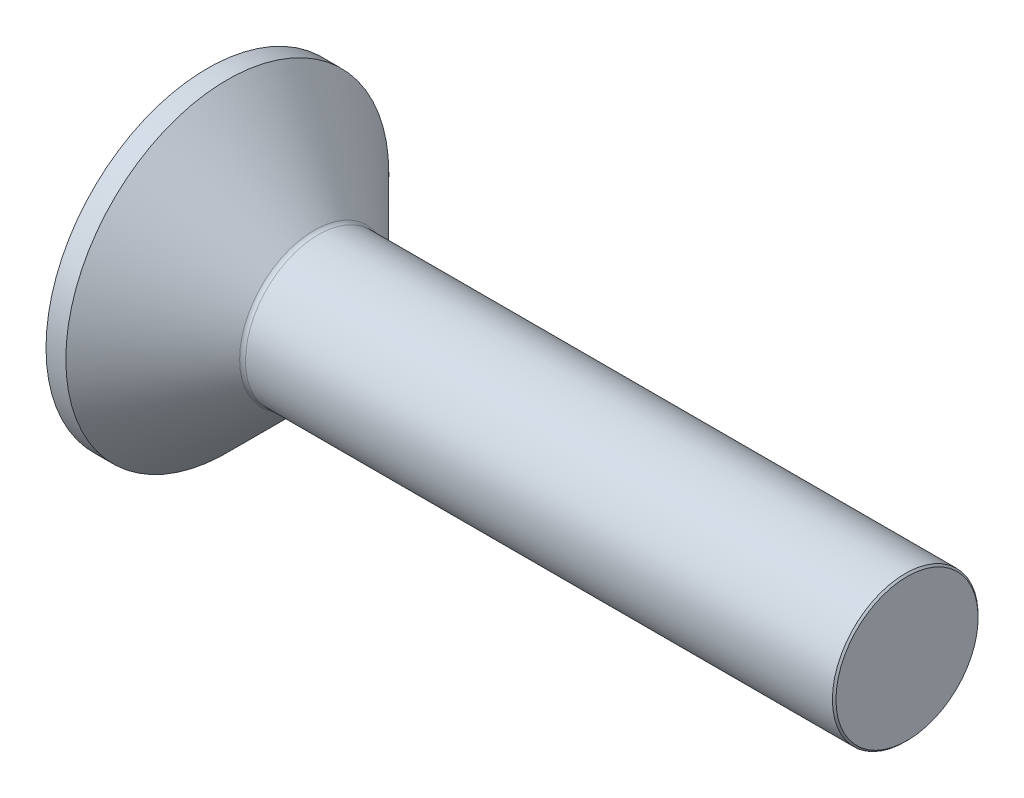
ISO-10303-21;
HEADER;
FILE_DESCRIPTION(('STEP AP214'),'2;1');
FILE_NAME('part.step','',(''),(''),'','','');
FILE_SCHEMA(('AUTOMOTIVE_DESIGN { 1 0 10303 214 1 1 1 1 }'));
ENDSEC;
DATA;
#1=APPLICATION_CONTEXT('core data for automotive mechanical design processes');
#2=APPLICATION_PROTOCOL_DEFINITION('international standard','automotive_design',2000,#1);
#3=PRODUCT_CONTEXT('',#1,'mechanical');
#4=PRODUCT('Part','Part','',(#3));
#5=PRODUCT_RELATED_PRODUCT_CATEGORY('part','',(#4));
#6=PRODUCT_DEFINITION_FORMATION('','',#4);
#7=PRODUCT_DEFINITION_CONTEXT('part definition',#1,'design');
#8=PRODUCT_DEFINITION('design','',#6,#7);
#9=PRODUCT_DEFINITION_SHAPE('','',#8);
#10=(LENGTH_UNIT() NAMED_UNIT(*) SI_UNIT(.MILLI.,.METRE.));
#11=(NAMED_UNIT(*) PLANE_ANGLE_UNIT() SI_UNIT($,.RADIAN.));
#12=(NAMED_UNIT(*) SI_UNIT($,.STERADIAN.) SOLID_ANGLE_UNIT());
#13=UNCERTAINTY_MEASURE_WITH_UNIT(LENGTH_MEASURE(1.E-05),#10,'distance_accuracy_value','');
#14=(GEOMETRIC_REPRESENTATION_CONTEXT(3) GLOBAL_UNCERTAINTY_ASSIGNED_CONTEXT((#13)) GLOBAL_UNIT_ASSIGNED_CONTEXT((#10,
#11,#12)) REPRESENTATION_CONTEXT('',''));
#15=CARTESIAN_POINT('',(0.,0.,0.));
#16=DIRECTION('',(0.,0.,1.));
#17=DIRECTION('',(1.,0.,0.));
#18=AXIS2_PLACEMENT_3D('',#15,#16,#17);
#19=CARTESIAN_POINT('',(0.,0.,0.));
#20=DIRECTION('',(-1.,0.,0.));
#21=DIRECTION('',(0.,0.,1.));
#22=AXIS2_PLACEMENT_3D('',#19,#20,#21);
#23=PLANE('',#22);
#24=CARTESIAN_POINT('',(0.,0.,0.));
#25=DIRECTION('',(-1.,0.,0.));
#26=DIRECTION('',(0.,0.,1.));
#27=AXIS2_PLACEMENT_3D('',#24,#25,#26);
#28=CIRCLE('',#27,2.77);
#29=CARTESIAN_POINT('',(0.,0.,2.77));
#30=VERTEX_POINT('',#29);
#31=EDGE_CURVE('E173',#30,#30,#28,.T.);
#32=ORIENTED_EDGE('',*,*,#31,.T.);
#33=EDGE_LOOP('',(#32));
#34=FACE_BOUND('',#33,.T.);
#35=DIRECTION('',(0.,-0.499999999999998,-0.86602540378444));
#36=VECTOR('',#35,1.);
#37=CARTESIAN_POINT('',(0.,-0.577350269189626,1.));
#38=LINE('',#37,#36);
#39=CARTESIAN_POINT('',(0.,-0.577350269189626,1.));
#40=VERTEX_POINT('',#39);
#41=CARTESIAN_POINT('',(0.,-1.15470053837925,0.));
#42=VERTEX_POINT('',#41);
#43=EDGE_CURVE('E131',#40,#42,#38,.T.);
#44=ORIENTED_EDGE('',*,*,#43,.T.);
#45=DIRECTION('',(0.,0.499999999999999,-0.866025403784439));
#46=VECTOR('',#45,1.);
#47=CARTESIAN_POINT('',(0.,-1.15470053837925,0.));
#48=LINE('',#47,#46);
#49=CARTESIAN_POINT('',(0.,-0.577350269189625,-1.));
#50=VERTEX_POINT('',#49);
#51=EDGE_CURVE('E61',#42,#50,#48,.T.);
#52=ORIENTED_EDGE('',*,*,#51,.T.);
#53=DIRECTION('',(0.,1.,0.));
#54=VECTOR('',#53,1.);
#55=CARTESIAN_POINT('',(0.,-0.577350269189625,-1.));
#56=LINE('',#55,#54);
#57=CARTESIAN_POINT('',(0.,0.577350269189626,-1.));
#58=VERTEX_POINT('',#57);
#59=EDGE_CURVE('E143',#50,#58,#56,.T.);
#60=ORIENTED_EDGE('',*,*,#59,.T.);
#61=DIRECTION('',(0.,0.5,0.866025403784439));
#62=VECTOR('',#61,1.);
#63=CARTESIAN_POINT('',(0.,0.577350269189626,-1.));
#64=LINE('',#63,#62);
#65=CARTESIAN_POINT('',(0.,1.15470053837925,0.));
#66=VERTEX_POINT('',#65);
#67=EDGE_CURVE('E284',#58,#66,#64,.T.);
#68=ORIENTED_EDGE('',*,*,#67,.T.);
#69=DIRECTION('',(0.,-0.499999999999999,0.866025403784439));
#70=VECTOR('',#69,1.);
#71=CARTESIAN_POINT('',(0.,1.15470053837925,0.));
#72=LINE('',#71,#70);
#73=CARTESIAN_POINT('',(0.,0.577350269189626,0.999999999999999));
#74=VERTEX_POINT('',#73);
#75=EDGE_CURVE('E288',#66,#74,#72,.T.);
#76=ORIENTED_EDGE('',*,*,#75,.T.);
#77=DIRECTION('',(0.,-1.,0.));
#78=VECTOR('',#77,1.);
#79=CARTESIAN_POINT('',(0.,0.577350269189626,0.999999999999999));
#80=LINE('',#79,#78);
#81=EDGE_CURVE('E292',#74,#40,#80,.T.);
#82=ORIENTED_EDGE('',*,*,#81,.T.);
#83=EDGE_LOOP('',(#44,#52,#60,#68,#76,#82));
#84=FACE_BOUND('',#83,.T.);
#85=ADVANCED_FACE('F45',(#34,#84),#23,.T.);
#86=CARTESIAN_POINT('',(0.,0.,0.));
#87=DIRECTION('',(-1.,0.,0.));
#88=DIRECTION('',(0.,0.,1.));
#89=AXIS2_PLACEMENT_3D('',#86,#87,#88);
#90=CYLINDRICAL_SURFACE('',#89,2.77);
#91=CARTESIAN_POINT('',(0.340000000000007,0.,0.));
#92=DIRECTION('',(-1.,0.,0.));
#93=DIRECTION('',(0.,0.,1.));
#94=AXIS2_PLACEMENT_3D('',#91,#92,#93);
#95=CIRCLE('',#94,2.77);
#96=CARTESIAN_POINT('',(0.340000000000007,0.,2.77));
#97=VERTEX_POINT('',#96);
#98=EDGE_CURVE('E169',#97,#97,#95,.T.);
#99=ORIENTED_EDGE('',*,*,#98,.T.);
#100=EDGE_LOOP('',(#99));
#101=FACE_BOUND('',#100,.T.);
#102=ORIENTED_EDGE('',*,*,#31,.F.);
#103=EDGE_LOOP('',(#102));
#104=FACE_BOUND('',#103,.T.);
#105=ADVANCED_FACE('F196',(#101,#104),#90,.T.);
#106=CARTESIAN_POINT('',(0.340000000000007,0.,0.));
#107=DIRECTION('',(-1.,0.,0.));
#108=DIRECTION('',(0.,0.,1.));
#109=AXIS2_PLACEMENT_3D('',#106,#107,#108);
#110=CONICAL_SURFACE('',#109,2.77,0.78539816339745);
#111=CARTESIAN_POINT('',(1.83071067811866,0.,0.));
#112=DIRECTION('',(-1.,0.,0.));
#113=DIRECTION('',(0.,0.,1.));
#114=AXIS2_PLACEMENT_3D('',#111,#112,#113);
#115=CIRCLE('',#114,1.27928932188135);
#116=CARTESIAN_POINT('',(1.83071067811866,0.,1.27928932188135));
#117=VERTEX_POINT('',#116);
#118=EDGE_CURVE('E54',#117,#117,#115,.T.);
#119=ORIENTED_EDGE('',*,*,#118,.T.);
#120=EDGE_LOOP('',(#119));
#121=FACE_BOUND('',#120,.T.);
#122=ORIENTED_EDGE('',*,*,#98,.F.);
#123=EDGE_LOOP('',(#122));
#124=FACE_BOUND('',#123,.T.);
#125=ADVANCED_FACE('F180',(#121,#124),#110,.T.);
#126=CARTESIAN_POINT('',(0.,0.,0.));
#127=DIRECTION('',(-1.,0.,0.));
#128=DIRECTION('',(0.,0.,1.));
#129=AXIS2_PLACEMENT_3D('',#126,#127,#128);
#130=CYLINDRICAL_SURFACE('',#129,1.25);
#131=CARTESIAN_POINT('',(1.90142135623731,0.,0.));
#132=DIRECTION('',(-1.,0.,0.));
#133=DIRECTION('',(0.,0.,1.));
#134=AXIS2_PLACEMENT_3D('',#131,#132,#133);
#135=CIRCLE('',#134,1.25);
#136=CARTESIAN_POINT('',(1.90142135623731,0.,1.25));
#137=VERTEX_POINT('',#136);
#138=EDGE_CURVE('E11',#137,#137,#135,.F.);
#139=ORIENTED_EDGE('',*,*,#138,.T.);
#140=EDGE_LOOP('',(#139));
#141=FACE_BOUND('',#140,.T.);
#142=CARTESIAN_POINT('',(11.9695,0.,0.));
#143=DIRECTION('',(-1.,0.,0.));
#144=DIRECTION('',(0.,0.,1.));
#145=AXIS2_PLACEMENT_3D('',#142,#143,#144);
#146=CIRCLE('',#145,1.25);
#147=CARTESIAN_POINT('',(11.9695,0.,1.25));
#148=VERTEX_POINT('',#147);
#149=EDGE_CURVE('E165',#148,#148,#146,.T.);
#150=ORIENTED_EDGE('',*,*,#149,.T.);
#151=EDGE_LOOP('',(#150));
#152=FACE_BOUND('',#151,.T.);
#153=ADVANCED_FACE('F207',(#141,#152),#130,.T.);
#154=CARTESIAN_POINT('',(12.,0.,0.));
#155=DIRECTION('',(-1.,0.,0.));
#156=DIRECTION('',(0.,0.,1.));
#157=AXIS2_PLACEMENT_3D('',#154,#155,#156);
#158=CONICAL_SURFACE('',#157,1.2195,0.785398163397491);
#159=ORIENTED_EDGE('',*,*,#149,.F.);
#160=EDGE_LOOP('',(#159));
#161=FACE_BOUND('',#160,.T.);
#162=CARTESIAN_POINT('',(12.,0.,0.));
#163=DIRECTION('',(-1.,0.,0.));
#164=DIRECTION('',(0.,0.,1.));
#165=AXIS2_PLACEMENT_3D('',#162,#163,#164);
#166=CIRCLE('',#165,1.2195);
#167=CARTESIAN_POINT('',(12.,0.,1.2195));
#168=VERTEX_POINT('',#167);
#169=EDGE_CURVE('E160',#168,#168,#166,.T.);
#170=ORIENTED_EDGE('',*,*,#169,.T.);
#171=EDGE_LOOP('',(#170));
#172=FACE_BOUND('',#171,.T.);
#173=ADVANCED_FACE('F191',(#161,#172),#158,.T.);
#174=CARTESIAN_POINT('',(12.,1.2195,0.));
#175=DIRECTION('',(1.,0.,0.));
#176=DIRECTION('',(0.,0.,-1.));
#177=AXIS2_PLACEMENT_3D('',#174,#175,#176);
#178=PLANE('',#177);
#179=ORIENTED_EDGE('',*,*,#169,.F.);
#180=EDGE_LOOP('',(#179));
#181=FACE_BOUND('',#180,.T.);
#182=ADVANCED_FACE('F184',(#181),#178,.T.);
#183=CARTESIAN_POINT('',(1.90142135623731,0.,0.));
#184=DIRECTION('',(-1.,0.,0.));
#185=DIRECTION('',(0.,0.,1.));
#186=AXIS2_PLACEMENT_3D('',#183,#184,#185);
#187=TOROIDAL_SURFACE('',#186,1.35,0.1);
#188=ORIENTED_EDGE('',*,*,#138,.F.);
#189=EDGE_LOOP('',(#188));
#190=FACE_BOUND('',#189,.T.);
#191=ORIENTED_EDGE('',*,*,#118,.F.);
#192=EDGE_LOOP('',(#191));
#193=FACE_BOUND('',#192,.T.);
#194=ADVANCED_FACE('F47',(#190,#193),#187,.F.);
#195=CARTESIAN_POINT('',(1.1,-1.15470053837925,0.));
#196=DIRECTION('',(0.,0.866025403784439,0.499999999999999));
#197=DIRECTION('',(0.,-0.499999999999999,0.866025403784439));
#198=AXIS2_PLACEMENT_3D('',#195,#196,#197);
#199=PLANE('',#198);
#200=ORIENTED_EDGE('',*,*,#51,.F.);
#201=DIRECTION('',(-1.,0.,0.));
#202=VECTOR('',#201,1.);
#203=CARTESIAN_POINT('',(1.1,-1.15470053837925,0.));
#204=LINE('',#203,#202);
#205=CARTESIAN_POINT('',(1.1,-1.15470053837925,0.));
#206=VERTEX_POINT('',#205);
#207=EDGE_CURVE('E279',#206,#42,#204,.T.);
#208=ORIENTED_EDGE('',*,*,#207,.F.);
#209=DIRECTION('',(0.,0.499999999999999,-0.866025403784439));
#210=VECTOR('',#209,1.);
#211=CARTESIAN_POINT('',(1.1,-1.15470053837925,0.));
#212=LINE('',#211,#210);
#213=CARTESIAN_POINT('',(1.1,-0.866025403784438,-0.499999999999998));
#214=VERTEX_POINT('',#213);
#215=EDGE_CURVE('E126',#206,#214,#212,.T.);
#216=ORIENTED_EDGE('',*,*,#215,.T.);
#217=CARTESIAN_POINT('',(1.1,-0.577350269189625,-1.));
#218=VERTEX_POINT('',#217);
#219=EDGE_CURVE('E122',#214,#218,#212,.T.);
#220=ORIENTED_EDGE('',*,*,#219,.T.);
#221=DIRECTION('',(-1.,0.,0.));
#222=VECTOR('',#221,1.);
#223=CARTESIAN_POINT('',(1.1,-0.577350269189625,-1.));
#224=LINE('',#223,#222);
#225=EDGE_CURVE('E124',#218,#50,#224,.T.);
#226=ORIENTED_EDGE('',*,*,#225,.T.);
#227=EDGE_LOOP('',(#200,#208,#216,#220,#226));
#228=FACE_BOUND('',#227,.T.);
#229=ADVANCED_FACE('F123',(#228),#199,.T.);
#230=CARTESIAN_POINT('',(1.1,-0.577350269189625,-1.));
#231=DIRECTION('',(0.,0.,1.));
#232=DIRECTION('',(1.,0.,0.));
#233=AXIS2_PLACEMENT_3D('',#230,#231,#232);
#234=PLANE('',#233);
#235=ORIENTED_EDGE('',*,*,#59,.F.);
#236=ORIENTED_EDGE('',*,*,#225,.F.);
#237=DIRECTION('',(0.,1.,0.));
#238=VECTOR('',#237,1.);
#239=CARTESIAN_POINT('',(1.1,-0.577350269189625,-1.));
#240=LINE('',#239,#238);
#241=CARTESIAN_POINT('',(1.1,0.,-1.));
#242=VERTEX_POINT('',#241);
#243=EDGE_CURVE('E69',#218,#242,#240,.T.);
#244=ORIENTED_EDGE('',*,*,#243,.T.);
#245=CARTESIAN_POINT('',(1.1,0.577350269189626,-1.));
#246=VERTEX_POINT('',#245);
#247=EDGE_CURVE('E138',#242,#246,#240,.T.);
#248=ORIENTED_EDGE('',*,*,#247,.T.);
#249=DIRECTION('',(-1.,0.,0.));
#250=VECTOR('',#249,1.);
#251=CARTESIAN_POINT('',(1.1,0.577350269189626,-1.));
#252=LINE('',#251,#250);
#253=EDGE_CURVE('E146',#246,#58,#252,.T.);
#254=ORIENTED_EDGE('',*,*,#253,.T.);
#255=EDGE_LOOP('',(#235,#236,#244,#248,#254));
#256=FACE_BOUND('',#255,.T.);
#257=ADVANCED_FACE('F140',(#256),#234,.T.);
#258=CARTESIAN_POINT('',(1.1,0.577350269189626,-1.));
#259=DIRECTION('',(0.,-0.866025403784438,0.5));
#260=DIRECTION('',(0.,-0.5,-0.866025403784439));
#261=AXIS2_PLACEMENT_3D('',#258,#259,#260);
#262=PLANE('',#261);
#263=ORIENTED_EDGE('',*,*,#67,.F.);
#264=ORIENTED_EDGE('',*,*,#253,.F.);
#265=DIRECTION('',(0.,0.5,0.866025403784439));
#266=VECTOR('',#265,1.);
#267=CARTESIAN_POINT('',(1.1,0.577350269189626,-1.));
#268=LINE('',#267,#266);
#269=CARTESIAN_POINT('',(1.1,0.866025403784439,-0.5));
#270=VERTEX_POINT('',#269);
#271=EDGE_CURVE('E254',#246,#270,#268,.T.);
#272=ORIENTED_EDGE('',*,*,#271,.T.);
#273=CARTESIAN_POINT('',(1.1,1.15470053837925,0.));
#274=VERTEX_POINT('',#273);
#275=EDGE_CURVE('E137',#270,#274,#268,.T.);
#276=ORIENTED_EDGE('',*,*,#275,.T.);
#277=DIRECTION('',(-1.,0.,0.));
#278=VECTOR('',#277,1.);
#279=CARTESIAN_POINT('',(1.1,1.15470053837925,0.));
#280=LINE('',#279,#278);
#281=EDGE_CURVE('E154',#274,#66,#280,.T.);
#282=ORIENTED_EDGE('',*,*,#281,.T.);
#283=EDGE_LOOP('',(#263,#264,#272,#276,#282));
#284=FACE_BOUND('',#283,.T.);
#285=ADVANCED_FACE('F221',(#284),#262,.T.);
#286=CARTESIAN_POINT('',(1.1,1.15470053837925,0.));
#287=DIRECTION('',(0.,-0.866025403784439,-0.499999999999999));
#288=DIRECTION('',(0.,0.499999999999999,-0.866025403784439));
#289=AXIS2_PLACEMENT_3D('',#286,#287,#288);
#290=PLANE('',#289);
#291=ORIENTED_EDGE('',*,*,#75,.F.);
#292=ORIENTED_EDGE('',*,*,#281,.F.);
#293=DIRECTION('',(0.,-0.499999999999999,0.866025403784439));
#294=VECTOR('',#293,1.);
#295=CARTESIAN_POINT('',(1.1,1.15470053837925,0.));
#296=LINE('',#295,#294);
#297=CARTESIAN_POINT('',(1.1,0.866025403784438,0.499999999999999));
#298=VERTEX_POINT('',#297);
#299=EDGE_CURVE('E264',#274,#298,#296,.T.);
#300=ORIENTED_EDGE('',*,*,#299,.T.);
#301=CARTESIAN_POINT('',(1.1,0.577350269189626,0.999999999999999));
#302=VERTEX_POINT('',#301);
#303=EDGE_CURVE('E260',#298,#302,#296,.T.);
#304=ORIENTED_EDGE('',*,*,#303,.T.);
#305=DIRECTION('',(-1.,0.,0.));
#306=VECTOR('',#305,1.);
#307=CARTESIAN_POINT('',(1.1,0.577350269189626,0.999999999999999));
#308=LINE('',#307,#306);
#309=EDGE_CURVE('E305',#302,#74,#308,.T.);
#310=ORIENTED_EDGE('',*,*,#309,.T.);
#311=EDGE_LOOP('',(#291,#292,#300,#304,#310));
#312=FACE_BOUND('',#311,.T.);
#313=ADVANCED_FACE('F224',(#312),#290,.T.);
#314=CARTESIAN_POINT('',(1.1,0.577350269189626,0.999999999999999));
#315=DIRECTION('',(0.,0.,-1.));
#316=DIRECTION('',(0.,1.,0.));
#317=AXIS2_PLACEMENT_3D('',#314,#315,#316);
#318=PLANE('',#317);
#319=ORIENTED_EDGE('',*,*,#81,.F.);
#320=ORIENTED_EDGE('',*,*,#309,.F.);
#321=DIRECTION('',(0.,-1.,0.));
#322=VECTOR('',#321,1.);
#323=CARTESIAN_POINT('',(1.1,0.577350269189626,0.999999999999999));
#324=LINE('',#323,#322);
#325=CARTESIAN_POINT('',(1.1,0.,1.));
#326=VERTEX_POINT('',#325);
#327=EDGE_CURVE('E270',#302,#326,#324,.T.);
#328=ORIENTED_EDGE('',*,*,#327,.T.);
#329=CARTESIAN_POINT('',(1.1,-0.577350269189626,1.));
#330=VERTEX_POINT('',#329);
#331=EDGE_CURVE('E269',#326,#330,#324,.T.);
#332=ORIENTED_EDGE('',*,*,#331,.T.);
#333=DIRECTION('',(-1.,0.,0.));
#334=VECTOR('',#333,1.);
#335=CARTESIAN_POINT('',(1.1,-0.577350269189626,1.));
#336=LINE('',#335,#334);
#337=EDGE_CURVE('E301',#330,#40,#336,.T.);
#338=ORIENTED_EDGE('',*,*,#337,.T.);
#339=EDGE_LOOP('',(#319,#320,#328,#332,#338));
#340=FACE_BOUND('',#339,.T.);
#341=ADVANCED_FACE('F228',(#340),#318,.T.);
#342=CARTESIAN_POINT('',(1.1,-0.577350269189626,1.));
#343=DIRECTION('',(0.,0.86602540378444,-0.499999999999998));
#344=DIRECTION('',(0.,0.499999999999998,0.86602540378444));
#345=AXIS2_PLACEMENT_3D('',#342,#343,#344);
#346=PLANE('',#345);
#347=ORIENTED_EDGE('',*,*,#43,.F.);
#348=ORIENTED_EDGE('',*,*,#337,.F.);
#349=DIRECTION('',(0.,-0.499999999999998,-0.86602540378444));
#350=VECTOR('',#349,1.);
#351=CARTESIAN_POINT('',(1.1,-0.577350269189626,1.));
#352=LINE('',#351,#350);
#353=CARTESIAN_POINT('',(1.1,-0.866025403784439,0.499999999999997));
#354=VERTEX_POINT('',#353);
#355=EDGE_CURVE('E275',#330,#354,#352,.T.);
#356=ORIENTED_EDGE('',*,*,#355,.T.);
#357=EDGE_CURVE('E274',#354,#206,#352,.T.);
#358=ORIENTED_EDGE('',*,*,#357,.T.);
#359=ORIENTED_EDGE('',*,*,#207,.T.);
#360=EDGE_LOOP('',(#347,#348,#356,#358,#359));
#361=FACE_BOUND('',#360,.T.);
#362=ADVANCED_FACE('F232',(#361),#346,.T.);
#363=CARTESIAN_POINT('',(1.1,-0.577350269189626,-1.));
#364=DIRECTION('',(1.,0.,0.));
#365=DIRECTION('',(0.,0.,-1.));
#366=AXIS2_PLACEMENT_3D('',#363,#364,#365);
#367=PLANE('',#366);
#368=ORIENTED_EDGE('',*,*,#243,.F.);
#369=ORIENTED_EDGE('',*,*,#219,.F.);
#370=CARTESIAN_POINT('',(1.1,0.,0.));
#371=DIRECTION('',(-1.,0.,0.));
#372=DIRECTION('',(0.,0.,1.));
#373=AXIS2_PLACEMENT_3D('',#370,#371,#372);
#374=CIRCLE('',#373,1.);
#375=EDGE_CURVE('E134',#242,#214,#374,.T.);
#376=ORIENTED_EDGE('',*,*,#375,.F.);
#377=EDGE_LOOP('',(#368,#369,#376));
#378=FACE_BOUND('',#377,.T.);
#379=ADVANCED_FACE('F133',(#378),#367,.F.);
#380=ORIENTED_EDGE('',*,*,#215,.F.);
#381=ORIENTED_EDGE('',*,*,#357,.F.);
#382=EDGE_CURVE('E151',#214,#354,#374,.T.);
#383=ORIENTED_EDGE('',*,*,#382,.F.);
#384=EDGE_LOOP('',(#380,#381,#383));
#385=FACE_BOUND('',#384,.T.);
#386=ADVANCED_FACE('F238',(#385),#367,.F.);
#387=ORIENTED_EDGE('',*,*,#355,.F.);
#388=ORIENTED_EDGE('',*,*,#331,.F.);
#389=EDGE_CURVE('E145',#354,#326,#374,.T.);
#390=ORIENTED_EDGE('',*,*,#389,.F.);
#391=EDGE_LOOP('',(#387,#388,#390));
#392=FACE_BOUND('',#391,.T.);
#393=ADVANCED_FACE('F242',(#392),#367,.F.);
#394=ORIENTED_EDGE('',*,*,#327,.F.);
#395=ORIENTED_EDGE('',*,*,#303,.F.);
#396=EDGE_CURVE('E153',#326,#298,#374,.T.);
#397=ORIENTED_EDGE('',*,*,#396,.F.);
#398=EDGE_LOOP('',(#394,#395,#397));
#399=FACE_BOUND('',#398,.T.);
#400=ADVANCED_FACE('F250',(#399),#367,.F.);
#401=ORIENTED_EDGE('',*,*,#299,.F.);
#402=ORIENTED_EDGE('',*,*,#275,.F.);
#403=EDGE_CURVE('E161',#298,#270,#374,.T.);
#404=ORIENTED_EDGE('',*,*,#403,.F.);
#405=EDGE_LOOP('',(#401,#402,#404));
#406=FACE_BOUND('',#405,.T.);
#407=ADVANCED_FACE('F245',(#406),#367,.F.);
#408=ORIENTED_EDGE('',*,*,#271,.F.);
#409=ORIENTED_EDGE('',*,*,#247,.F.);
#410=EDGE_CURVE('E255',#270,#242,#374,.T.);
#411=ORIENTED_EDGE('',*,*,#410,.F.);
#412=EDGE_LOOP('',(#408,#409,#411));
#413=FACE_BOUND('',#412,.T.);
#414=ADVANCED_FACE('F216',(#413),#367,.F.);
#415=CARTESIAN_POINT('',(1.1,0.,0.));
#416=DIRECTION('',(-1.,0.,0.));
#417=DIRECTION('',(0.,0.,1.));
#418=AXIS2_PLACEMENT_3D('',#415,#416,#417);
#419=CONICAL_SURFACE('',#418,1.,1.04719755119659);
#420=CARTESIAN_POINT('',(1.67735026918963,0.,0.));
#421=VERTEX_POINT('',#420);
#422=VERTEX_LOOP('',#421);
#423=FACE_BOUND('',#422,.T.);
#424=ORIENTED_EDGE('',*,*,#396,.T.);
#425=ORIENTED_EDGE('',*,*,#403,.T.);
#426=ORIENTED_EDGE('',*,*,#410,.T.);
#427=ORIENTED_EDGE('',*,*,#375,.T.);
#428=ORIENTED_EDGE('',*,*,#382,.T.);
#429=ORIENTED_EDGE('',*,*,#389,.T.);
#430=EDGE_LOOP('',(#424,#425,#426,#427,#428,#429));
#431=FACE_BOUND('',#430,.T.);
#432=ADVANCED_FACE('F214',(#423,#431),#419,.F.);
#433=CLOSED_SHELL('',(#85,#105,#125,#153,#173,#182,#194,#229,#257,#285,#313,#341,#362,#379,#386,
#393,#400,#407,#414,#432));
#434=MANIFOLD_SOLID_BREP('B2',#433);
#435=ADVANCED_BREP_SHAPE_REPRESENTATION('',(#18,#434),#14);
#436=SHAPE_DEFINITION_REPRESENTATION(#9,#435);
ENDSEC;
END-ISO-10303-21;
